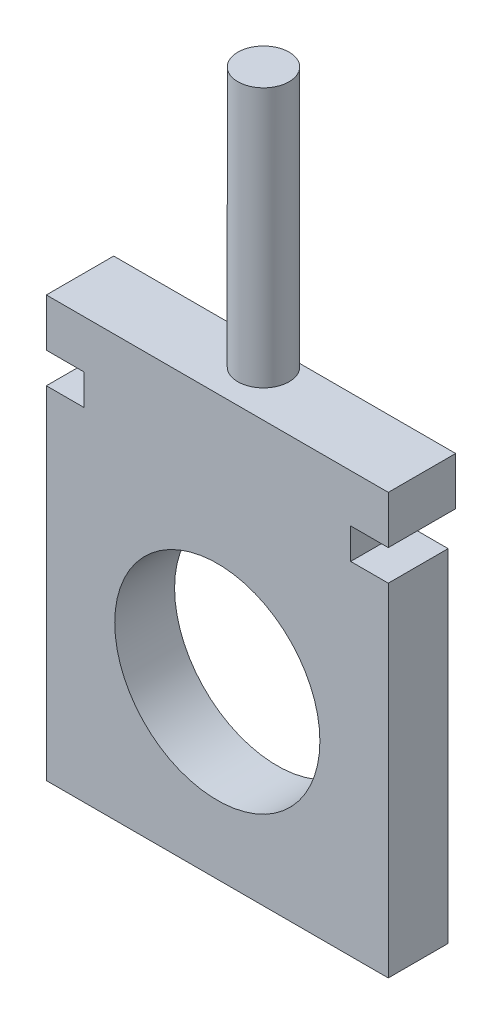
ISO-10303-21;
HEADER;
FILE_DESCRIPTION(('STEP AP214'),'2;1');
FILE_NAME('part.step','',(''),(''),'','','');
FILE_SCHEMA(('AUTOMOTIVE_DESIGN { 1 0 10303 214 1 1 1 1 }'));
ENDSEC;
DATA;
#1=APPLICATION_CONTEXT('core data for automotive mechanical design processes');
#2=APPLICATION_PROTOCOL_DEFINITION('international standard','automotive_design',2000,#1);
#3=PRODUCT_CONTEXT('',#1,'mechanical');
#4=PRODUCT('Part','Part','',(#3));
#5=PRODUCT_RELATED_PRODUCT_CATEGORY('part','',(#4));
#6=PRODUCT_DEFINITION_FORMATION('','',#4);
#7=PRODUCT_DEFINITION_CONTEXT('part definition',#1,'design');
#8=PRODUCT_DEFINITION('design','',#6,#7);
#9=PRODUCT_DEFINITION_SHAPE('','',#8);
#10=(LENGTH_UNIT() NAMED_UNIT(*) SI_UNIT(.MILLI.,.METRE.));
#11=(NAMED_UNIT(*) PLANE_ANGLE_UNIT() SI_UNIT($,.RADIAN.));
#12=(NAMED_UNIT(*) SI_UNIT($,.STERADIAN.) SOLID_ANGLE_UNIT());
#13=UNCERTAINTY_MEASURE_WITH_UNIT(LENGTH_MEASURE(1.E-05),#10,'distance_accuracy_value','');
#14=(GEOMETRIC_REPRESENTATION_CONTEXT(3) GLOBAL_UNCERTAINTY_ASSIGNED_CONTEXT((#13)) GLOBAL_UNIT_ASSIGNED_CONTEXT((#10,
#11,#12)) REPRESENTATION_CONTEXT('',''));
#15=CARTESIAN_POINT('',(0.,0.,0.));
#16=DIRECTION('',(0.,0.,1.));
#17=DIRECTION('',(1.,0.,0.));
#18=AXIS2_PLACEMENT_3D('',#15,#16,#17);
#19=CARTESIAN_POINT('',(-63.5,63.5,22.225));
#20=DIRECTION('',(0.,-1.,0.));
#21=DIRECTION('',(0.,0.,-1.));
#22=AXIS2_PLACEMENT_3D('',#19,#20,#21);
#23=PLANE('',#22);
#24=DIRECTION('',(0.,0.,-1.));
#25=VECTOR('',#24,1.);
#26=CARTESIAN_POINT('',(49.53,63.5,22.225));
#27=LINE('',#26,#25);
#28=CARTESIAN_POINT('',(49.53,63.5,22.225));
#29=VERTEX_POINT('',#28);
#30=CARTESIAN_POINT('',(49.53,63.5,9.525));
#31=VERTEX_POINT('',#30);
#32=EDGE_CURVE('E177',#29,#31,#27,.T.);
#33=ORIENTED_EDGE('',*,*,#32,.F.);
#34=DIRECTION('',(-1.,0.,0.));
#35=VECTOR('',#34,1.);
#36=CARTESIAN_POINT('',(-63.5,63.5,22.225));
#37=LINE('',#36,#35);
#38=CARTESIAN_POINT('',(63.5,63.5,22.225));
#39=VERTEX_POINT('',#38);
#40=EDGE_CURVE('E242',#39,#29,#37,.T.);
#41=ORIENTED_EDGE('',*,*,#40,.F.);
#42=DIRECTION('',(0.,0.,-1.));
#43=VECTOR('',#42,1.);
#44=CARTESIAN_POINT('',(63.5,63.5,22.225));
#45=LINE('',#44,#43);
#46=CARTESIAN_POINT('',(63.5,63.5,0.));
#47=VERTEX_POINT('',#46);
#48=EDGE_CURVE('E42',#39,#47,#45,.T.);
#49=ORIENTED_EDGE('',*,*,#48,.T.);
#50=DIRECTION('',(-1.,0.,0.));
#51=VECTOR('',#50,1.);
#52=CARTESIAN_POINT('',(-63.5,63.5,0.));
#53=LINE('',#52,#51);
#54=CARTESIAN_POINT('',(-63.5,63.5,0.));
#55=VERTEX_POINT('',#54);
#56=EDGE_CURVE('E258',#47,#55,#53,.T.);
#57=ORIENTED_EDGE('',*,*,#56,.T.);
#58=DIRECTION('',(0.,0.,-1.));
#59=VECTOR('',#58,1.);
#60=CARTESIAN_POINT('',(-63.5,63.5,22.225));
#61=LINE('',#60,#59);
#62=CARTESIAN_POINT('',(-63.5,63.5,22.225));
#63=VERTEX_POINT('',#62);
#64=EDGE_CURVE('E270',#63,#55,#61,.T.);
#65=ORIENTED_EDGE('',*,*,#64,.F.);
#66=CARTESIAN_POINT('',(-49.53,63.5,22.225));
#67=VERTEX_POINT('',#66);
#68=EDGE_CURVE('E239',#67,#63,#37,.T.);
#69=ORIENTED_EDGE('',*,*,#68,.F.);
#70=DIRECTION('',(0.,0.,1.));
#71=VECTOR('',#70,1.);
#72=CARTESIAN_POINT('',(-49.53,63.5,22.225));
#73=LINE('',#72,#71);
#74=CARTESIAN_POINT('',(-49.53,63.5,9.525));
#75=VERTEX_POINT('',#74);
#76=EDGE_CURVE('E211',#75,#67,#73,.T.);
#77=ORIENTED_EDGE('',*,*,#76,.F.);
#78=DIRECTION('',(-1.,0.,0.));
#79=VECTOR('',#78,1.);
#80=CARTESIAN_POINT('',(-49.53,63.5,9.525));
#81=LINE('',#80,#79);
#82=EDGE_CURVE('E57',#31,#75,#81,.T.);
#83=ORIENTED_EDGE('',*,*,#82,.F.);
#84=EDGE_LOOP('',(#33,#41,#49,#57,#65,#69,#77,#83));
#85=FACE_BOUND('',#84,.T.);
#86=ADVANCED_FACE('F33',(#85),#23,.F.);
#87=CARTESIAN_POINT('',(63.5,63.5,22.225));
#88=DIRECTION('',(-1.,0.,0.));
#89=DIRECTION('',(0.,-1.,0.));
#90=AXIS2_PLACEMENT_3D('',#87,#88,#89);
#91=PLANE('',#90);
#92=DIRECTION('',(0.,1.,0.));
#93=VECTOR('',#92,1.);
#94=CARTESIAN_POINT('',(63.5,63.5,0.));
#95=LINE('',#94,#93);
#96=CARTESIAN_POINT('',(63.5,-63.5,0.));
#97=VERTEX_POINT('',#96);
#98=EDGE_CURVE('E255',#97,#47,#95,.T.);
#99=ORIENTED_EDGE('',*,*,#98,.T.);
#100=ORIENTED_EDGE('',*,*,#48,.F.);
#101=DIRECTION('',(0.,1.,0.));
#102=VECTOR('',#101,1.);
#103=CARTESIAN_POINT('',(63.5,63.5,22.225));
#104=LINE('',#103,#102);
#105=CARTESIAN_POINT('',(63.5,-63.5,22.225));
#106=VERTEX_POINT('',#105);
#107=EDGE_CURVE('E243',#106,#39,#104,.T.);
#108=ORIENTED_EDGE('',*,*,#107,.F.);
#109=DIRECTION('',(0.,0.,-1.));
#110=VECTOR('',#109,1.);
#111=CARTESIAN_POINT('',(63.5,-63.5,22.225));
#112=LINE('',#111,#110);
#113=EDGE_CURVE('E254',#106,#97,#112,.T.);
#114=ORIENTED_EDGE('',*,*,#113,.T.);
#115=EDGE_LOOP('',(#99,#100,#108,#114));
#116=FACE_BOUND('',#115,.T.);
#117=ADVANCED_FACE('F35',(#116),#91,.F.);
#118=CARTESIAN_POINT('',(-63.5,63.5,22.225));
#119=DIRECTION('',(1.,0.,0.));
#120=DIRECTION('',(0.,0.,-1.));
#121=AXIS2_PLACEMENT_3D('',#118,#119,#120);
#122=PLANE('',#121);
#123=DIRECTION('',(0.,-1.,0.));
#124=VECTOR('',#123,1.);
#125=CARTESIAN_POINT('',(-63.5,63.5,0.));
#126=LINE('',#125,#124);
#127=CARTESIAN_POINT('',(-63.5,-63.5,0.));
#128=VERTEX_POINT('',#127);
#129=EDGE_CURVE('E261',#55,#128,#126,.T.);
#130=ORIENTED_EDGE('',*,*,#129,.T.);
#131=DIRECTION('',(0.,0.,-1.));
#132=VECTOR('',#131,1.);
#133=CARTESIAN_POINT('',(-63.5,-63.5,22.225));
#134=LINE('',#133,#132);
#135=CARTESIAN_POINT('',(-63.5,-63.5,22.225));
#136=VERTEX_POINT('',#135);
#137=EDGE_CURVE('E267',#136,#128,#134,.T.);
#138=ORIENTED_EDGE('',*,*,#137,.F.);
#139=DIRECTION('',(0.,-1.,0.));
#140=VECTOR('',#139,1.);
#141=CARTESIAN_POINT('',(-63.5,63.5,22.225));
#142=LINE('',#141,#140);
#143=EDGE_CURVE('E249',#63,#136,#142,.T.);
#144=ORIENTED_EDGE('',*,*,#143,.F.);
#145=ORIENTED_EDGE('',*,*,#64,.T.);
#146=EDGE_LOOP('',(#130,#138,#144,#145));
#147=FACE_BOUND('',#146,.T.);
#148=ADVANCED_FACE('F285',(#147),#122,.F.);
#149=CARTESIAN_POINT('',(-63.5,-63.5,22.225));
#150=DIRECTION('',(0.,1.,0.));
#151=DIRECTION('',(0.,0.,1.));
#152=AXIS2_PLACEMENT_3D('',#149,#150,#151);
#153=PLANE('',#152);
#154=DIRECTION('',(1.,0.,0.));
#155=VECTOR('',#154,1.);
#156=CARTESIAN_POINT('',(-63.5,-63.5,0.));
#157=LINE('',#156,#155);
#158=EDGE_CURVE('E263',#128,#97,#157,.T.);
#159=ORIENTED_EDGE('',*,*,#158,.T.);
#160=ORIENTED_EDGE('',*,*,#113,.F.);
#161=DIRECTION('',(1.,0.,0.));
#162=VECTOR('',#161,1.);
#163=CARTESIAN_POINT('',(-63.5,-63.5,22.225));
#164=LINE('',#163,#162);
#165=EDGE_CURVE('E252',#136,#106,#164,.T.);
#166=ORIENTED_EDGE('',*,*,#165,.F.);
#167=ORIENTED_EDGE('',*,*,#137,.T.);
#168=EDGE_LOOP('',(#159,#160,#166,#167));
#169=FACE_BOUND('',#168,.T.);
#170=ADVANCED_FACE('F289',(#169),#153,.F.);
#171=CARTESIAN_POINT('',(0.,0.,22.225));
#172=DIRECTION('',(0.,0.,1.));
#173=DIRECTION('',(1.,0.,0.));
#174=AXIS2_PLACEMENT_3D('',#171,#172,#173);
#175=PLANE('',#174);
#176=CARTESIAN_POINT('',(0.,0.,22.225));
#177=DIRECTION('',(0.,0.,1.));
#178=DIRECTION('',(1.,0.,0.));
#179=AXIS2_PLACEMENT_3D('',#176,#177,#178);
#180=CIRCLE('',#179,38.1);
#181=CARTESIAN_POINT('',(38.1,0.,22.225));
#182=VERTEX_POINT('',#181);
#183=EDGE_CURVE('E295',#182,#182,#180,.T.);
#184=ORIENTED_EDGE('',*,*,#183,.F.);
#185=EDGE_LOOP('',(#184));
#186=FACE_BOUND('',#185,.T.);
#187=ORIENTED_EDGE('',*,*,#107,.T.);
#188=ORIENTED_EDGE('',*,*,#40,.T.);
#189=DIRECTION('',(0.,-1.,0.));
#190=VECTOR('',#189,1.);
#191=CARTESIAN_POINT('',(49.53,74.93,22.225));
#192=LINE('',#191,#190);
#193=CARTESIAN_POINT('',(49.53,74.93,22.225));
#194=VERTEX_POINT('',#193);
#195=EDGE_CURVE('E203',#194,#29,#192,.T.);
#196=ORIENTED_EDGE('',*,*,#195,.F.);
#197=DIRECTION('',(1.,0.,0.));
#198=VECTOR('',#197,1.);
#199=CARTESIAN_POINT('',(-63.5,74.93,22.225));
#200=LINE('',#199,#198);
#201=CARTESIAN_POINT('',(63.5,74.93,22.225));
#202=VERTEX_POINT('',#201);
#203=EDGE_CURVE('E162',#194,#202,#200,.T.);
#204=ORIENTED_EDGE('',*,*,#203,.T.);
#205=DIRECTION('',(0.,-1.,0.));
#206=VECTOR('',#205,1.);
#207=CARTESIAN_POINT('',(63.5,92.71,22.225));
#208=LINE('',#207,#206);
#209=CARTESIAN_POINT('',(63.5,92.71,22.225));
#210=VERTEX_POINT('',#209);
#211=EDGE_CURVE('E178',#210,#202,#208,.T.);
#212=ORIENTED_EDGE('',*,*,#211,.F.);
#213=DIRECTION('',(1.,0.,0.));
#214=VECTOR('',#213,1.);
#215=CARTESIAN_POINT('',(-63.5,92.71,22.225));
#216=LINE('',#215,#214);
#217=CARTESIAN_POINT('',(-63.5,92.71,22.225));
#218=VERTEX_POINT('',#217);
#219=EDGE_CURVE('E156',#218,#210,#216,.T.);
#220=ORIENTED_EDGE('',*,*,#219,.F.);
#221=DIRECTION('',(0.,-1.,0.));
#222=VECTOR('',#221,1.);
#223=CARTESIAN_POINT('',(-63.5,92.71,22.225));
#224=LINE('',#223,#222);
#225=CARTESIAN_POINT('',(-63.5,74.93,22.225));
#226=VERTEX_POINT('',#225);
#227=EDGE_CURVE('E174',#218,#226,#224,.T.);
#228=ORIENTED_EDGE('',*,*,#227,.T.);
#229=CARTESIAN_POINT('',(-49.53,74.93,22.225));
#230=VERTEX_POINT('',#229);
#231=EDGE_CURVE('E171',#226,#230,#200,.T.);
#232=ORIENTED_EDGE('',*,*,#231,.T.);
#233=DIRECTION('',(0.,-1.,0.));
#234=VECTOR('',#233,1.);
#235=CARTESIAN_POINT('',(-49.53,74.93,22.225));
#236=LINE('',#235,#234);
#237=EDGE_CURVE('E230',#230,#67,#236,.T.);
#238=ORIENTED_EDGE('',*,*,#237,.T.);
#239=ORIENTED_EDGE('',*,*,#68,.T.);
#240=ORIENTED_EDGE('',*,*,#143,.T.);
#241=ORIENTED_EDGE('',*,*,#165,.T.);
#242=EDGE_LOOP('',(#187,#188,#196,#204,#212,#220,#228,#232,#238,#239,#240,#241));
#243=FACE_BOUND('',#242,.T.);
#244=ADVANCED_FACE('F200',(#186,#243),#175,.T.);
#245=CARTESIAN_POINT('',(0.,0.,0.));
#246=DIRECTION('',(0.,0.,1.));
#247=DIRECTION('',(1.,0.,0.));
#248=AXIS2_PLACEMENT_3D('',#245,#246,#247);
#249=PLANE('',#248);
#250=CARTESIAN_POINT('',(0.,0.,0.));
#251=DIRECTION('',(0.,0.,1.));
#252=DIRECTION('',(1.,0.,0.));
#253=AXIS2_PLACEMENT_3D('',#250,#251,#252);
#254=CIRCLE('',#253,38.1);
#255=CARTESIAN_POINT('',(38.1,0.,0.));
#256=VERTEX_POINT('',#255);
#257=EDGE_CURVE('E259',#256,#256,#254,.T.);
#258=ORIENTED_EDGE('',*,*,#257,.T.);
#259=EDGE_LOOP('',(#258));
#260=FACE_BOUND('',#259,.T.);
#261=ORIENTED_EDGE('',*,*,#98,.F.);
#262=ORIENTED_EDGE('',*,*,#158,.F.);
#263=ORIENTED_EDGE('',*,*,#129,.F.);
#264=ORIENTED_EDGE('',*,*,#56,.F.);
#265=EDGE_LOOP('',(#261,#262,#263,#264));
#266=FACE_BOUND('',#265,.T.);
#267=ADVANCED_FACE('F281',(#260,#266),#249,.F.);
#268=CARTESIAN_POINT('',(0.,0.,0.));
#269=DIRECTION('',(0.,0.,1.));
#270=DIRECTION('',(1.,0.,0.));
#271=AXIS2_PLACEMENT_3D('',#268,#269,#270);
#272=CYLINDRICAL_SURFACE('',#271,38.1);
#273=ORIENTED_EDGE('',*,*,#257,.F.);
#274=EDGE_LOOP('',(#273));
#275=FACE_BOUND('',#274,.T.);
#276=ORIENTED_EDGE('',*,*,#183,.T.);
#277=EDGE_LOOP('',(#276));
#278=FACE_BOUND('',#277,.T.);
#279=ADVANCED_FACE('F298',(#275,#278),#272,.F.);
#280=CARTESIAN_POINT('',(49.53,74.93,22.225));
#281=DIRECTION('',(-1.,0.,0.));
#282=DIRECTION('',(0.,0.,1.));
#283=AXIS2_PLACEMENT_3D('',#280,#281,#282);
#284=PLANE('',#283);
#285=ORIENTED_EDGE('',*,*,#32,.T.);
#286=DIRECTION('',(0.,-1.,0.));
#287=VECTOR('',#286,1.);
#288=CARTESIAN_POINT('',(49.53,74.93,9.525));
#289=LINE('',#288,#287);
#290=CARTESIAN_POINT('',(49.53,74.93,9.525));
#291=VERTEX_POINT('',#290);
#292=EDGE_CURVE('E233',#291,#31,#289,.T.);
#293=ORIENTED_EDGE('',*,*,#292,.F.);
#294=DIRECTION('',(0.,0.,-1.));
#295=VECTOR('',#294,1.);
#296=CARTESIAN_POINT('',(49.53,74.93,22.225));
#297=LINE('',#296,#295);
#298=EDGE_CURVE('E207',#194,#291,#297,.T.);
#299=ORIENTED_EDGE('',*,*,#298,.F.);
#300=ORIENTED_EDGE('',*,*,#195,.T.);
#301=EDGE_LOOP('',(#285,#293,#299,#300));
#302=FACE_BOUND('',#301,.T.);
#303=ADVANCED_FACE('F296',(#302),#284,.F.);
#304=CARTESIAN_POINT('',(-49.53,74.93,9.525));
#305=DIRECTION('',(0.,0.,1.));
#306=DIRECTION('',(1.,0.,0.));
#307=AXIS2_PLACEMENT_3D('',#304,#305,#306);
#308=PLANE('',#307);
#309=ORIENTED_EDGE('',*,*,#82,.T.);
#310=DIRECTION('',(0.,-1.,0.));
#311=VECTOR('',#310,1.);
#312=CARTESIAN_POINT('',(-49.53,74.93,9.525));
#313=LINE('',#312,#311);
#314=CARTESIAN_POINT('',(-49.53,74.93,9.525));
#315=VERTEX_POINT('',#314);
#316=EDGE_CURVE('E225',#315,#75,#313,.T.);
#317=ORIENTED_EDGE('',*,*,#316,.F.);
#318=DIRECTION('',(-1.,0.,0.));
#319=VECTOR('',#318,1.);
#320=CARTESIAN_POINT('',(-49.53,74.93,9.525));
#321=LINE('',#320,#319);
#322=EDGE_CURVE('E208',#291,#315,#321,.T.);
#323=ORIENTED_EDGE('',*,*,#322,.F.);
#324=ORIENTED_EDGE('',*,*,#292,.T.);
#325=EDGE_LOOP('',(#309,#317,#323,#324));
#326=FACE_BOUND('',#325,.T.);
#327=ADVANCED_FACE('F294',(#326),#308,.F.);
#328=CARTESIAN_POINT('',(-49.53,74.93,22.225));
#329=DIRECTION('',(1.,0.,0.));
#330=DIRECTION('',(0.,0.,-1.));
#331=AXIS2_PLACEMENT_3D('',#328,#329,#330);
#332=PLANE('',#331);
#333=ORIENTED_EDGE('',*,*,#76,.T.);
#334=ORIENTED_EDGE('',*,*,#237,.F.);
#335=DIRECTION('',(0.,0.,1.));
#336=VECTOR('',#335,1.);
#337=CARTESIAN_POINT('',(-49.53,74.93,22.225));
#338=LINE('',#337,#336);
#339=EDGE_CURVE('E212',#315,#230,#338,.T.);
#340=ORIENTED_EDGE('',*,*,#339,.F.);
#341=ORIENTED_EDGE('',*,*,#316,.T.);
#342=EDGE_LOOP('',(#333,#334,#340,#341));
#343=FACE_BOUND('',#342,.T.);
#344=ADVANCED_FACE('F291',(#343),#332,.F.);
#345=CARTESIAN_POINT('',(0.,74.93,0.));
#346=DIRECTION('',(0.,1.,0.));
#347=DIRECTION('',(0.,0.,1.));
#348=AXIS2_PLACEMENT_3D('',#345,#346,#347);
#349=PLANE('',#348);
#350=ORIENTED_EDGE('',*,*,#203,.F.);
#351=ORIENTED_EDGE('',*,*,#298,.T.);
#352=ORIENTED_EDGE('',*,*,#322,.T.);
#353=ORIENTED_EDGE('',*,*,#339,.T.);
#354=ORIENTED_EDGE('',*,*,#231,.F.);
#355=DIRECTION('',(0.,0.,1.));
#356=VECTOR('',#355,1.);
#357=CARTESIAN_POINT('',(-63.5,74.93,-2.794));
#358=LINE('',#357,#356);
#359=CARTESIAN_POINT('',(-63.5,74.93,-2.794));
#360=VERTEX_POINT('',#359);
#361=EDGE_CURVE('E150',#360,#226,#358,.T.);
#362=ORIENTED_EDGE('',*,*,#361,.F.);
#363=DIRECTION('',(-1.,0.,0.));
#364=VECTOR('',#363,1.);
#365=CARTESIAN_POINT('',(-63.5,74.93,-2.794));
#366=LINE('',#365,#364);
#367=CARTESIAN_POINT('',(63.5,74.93,-2.794));
#368=VERTEX_POINT('',#367);
#369=EDGE_CURVE('E157',#368,#360,#366,.T.);
#370=ORIENTED_EDGE('',*,*,#369,.F.);
#371=DIRECTION('',(0.,0.,-1.));
#372=VECTOR('',#371,1.);
#373=CARTESIAN_POINT('',(63.5,74.93,-2.794));
#374=LINE('',#373,#372);
#375=EDGE_CURVE('E165',#202,#368,#374,.T.);
#376=ORIENTED_EDGE('',*,*,#375,.F.);
#377=EDGE_LOOP('',(#350,#351,#352,#353,#354,#362,#370,#376));
#378=FACE_BOUND('',#377,.T.);
#379=ADVANCED_FACE('F192',(#378),#349,.F.);
#380=CARTESIAN_POINT('',(-63.5,92.71,-2.794));
#381=DIRECTION('',(1.,0.,0.));
#382=DIRECTION('',(0.,0.,-1.));
#383=AXIS2_PLACEMENT_3D('',#380,#381,#382);
#384=PLANE('',#383);
#385=ORIENTED_EDGE('',*,*,#361,.T.);
#386=ORIENTED_EDGE('',*,*,#227,.F.);
#387=DIRECTION('',(0.,0.,1.));
#388=VECTOR('',#387,1.);
#389=CARTESIAN_POINT('',(-63.5,92.71,-2.794));
#390=LINE('',#389,#388);
#391=CARTESIAN_POINT('',(-63.5,92.71,-2.794));
#392=VERTEX_POINT('',#391);
#393=EDGE_CURVE('E153',#392,#218,#390,.T.);
#394=ORIENTED_EDGE('',*,*,#393,.F.);
#395=DIRECTION('',(0.,-1.,0.));
#396=VECTOR('',#395,1.);
#397=CARTESIAN_POINT('',(-63.5,92.71,-2.794));
#398=LINE('',#397,#396);
#399=EDGE_CURVE('E135',#392,#360,#398,.T.);
#400=ORIENTED_EDGE('',*,*,#399,.T.);
#401=EDGE_LOOP('',(#385,#386,#394,#400));
#402=FACE_BOUND('',#401,.T.);
#403=ADVANCED_FACE('F196',(#402),#384,.F.);
#404=CARTESIAN_POINT('',(63.5,92.71,-2.794));
#405=DIRECTION('',(-1.,0.,0.));
#406=DIRECTION('',(0.,0.,1.));
#407=AXIS2_PLACEMENT_3D('',#404,#405,#406);
#408=PLANE('',#407);
#409=ORIENTED_EDGE('',*,*,#375,.T.);
#410=DIRECTION('',(0.,-1.,0.));
#411=VECTOR('',#410,1.);
#412=CARTESIAN_POINT('',(63.5,92.71,-2.794));
#413=LINE('',#412,#411);
#414=CARTESIAN_POINT('',(63.5,92.71,-2.794));
#415=VERTEX_POINT('',#414);
#416=EDGE_CURVE('E181',#415,#368,#413,.T.);
#417=ORIENTED_EDGE('',*,*,#416,.F.);
#418=DIRECTION('',(0.,0.,-1.));
#419=VECTOR('',#418,1.);
#420=CARTESIAN_POINT('',(63.5,92.71,-2.794));
#421=LINE('',#420,#419);
#422=EDGE_CURVE('E131',#210,#415,#421,.T.);
#423=ORIENTED_EDGE('',*,*,#422,.F.);
#424=ORIENTED_EDGE('',*,*,#211,.T.);
#425=EDGE_LOOP('',(#409,#417,#423,#424));
#426=FACE_BOUND('',#425,.T.);
#427=ADVANCED_FACE('F187',(#426),#408,.F.);
#428=CARTESIAN_POINT('',(-63.5,92.71,-2.794));
#429=DIRECTION('',(0.,0.,1.));
#430=DIRECTION('',(1.,0.,0.));
#431=AXIS2_PLACEMENT_3D('',#428,#429,#430);
#432=PLANE('',#431);
#433=ORIENTED_EDGE('',*,*,#369,.T.);
#434=ORIENTED_EDGE('',*,*,#399,.F.);
#435=DIRECTION('',(-1.,0.,0.));
#436=VECTOR('',#435,1.);
#437=CARTESIAN_POINT('',(-63.5,92.71,-2.794));
#438=LINE('',#437,#436);
#439=CARTESIAN_POINT('',(-5.35964075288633,92.71,-2.794));
#440=VERTEX_POINT('',#439);
#441=EDGE_CURVE('E138',#440,#392,#438,.T.);
#442=ORIENTED_EDGE('',*,*,#441,.F.);
#443=CARTESIAN_POINT('',(5.35964075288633,92.71,-2.794));
#444=VERTEX_POINT('',#443);
#445=EDGE_CURVE('E136',#444,#440,#438,.T.);
#446=ORIENTED_EDGE('',*,*,#445,.F.);
#447=EDGE_CURVE('E127',#415,#444,#438,.T.);
#448=ORIENTED_EDGE('',*,*,#447,.F.);
#449=ORIENTED_EDGE('',*,*,#416,.T.);
#450=EDGE_LOOP('',(#433,#434,#442,#446,#448,#449));
#451=FACE_BOUND('',#450,.T.);
#452=ADVANCED_FACE('F140',(#451),#432,.F.);
#453=CARTESIAN_POINT('',(0.,92.71,0.));
#454=DIRECTION('',(0.,1.,0.));
#455=DIRECTION('',(0.,0.,1.));
#456=AXIS2_PLACEMENT_3D('',#453,#454,#455);
#457=PLANE('',#456);
#458=CARTESIAN_POINT('',(0.,92.71,5.08));
#459=DIRECTION('',(0.,1.,0.));
#460=DIRECTION('',(0.,0.,1.));
#461=AXIS2_PLACEMENT_3D('',#458,#459,#460);
#462=CIRCLE('',#461,9.525);
#463=EDGE_CURVE('E11',#440,#444,#462,.T.);
#464=ORIENTED_EDGE('',*,*,#463,.F.);
#465=ORIENTED_EDGE('',*,*,#441,.T.);
#466=ORIENTED_EDGE('',*,*,#393,.T.);
#467=ORIENTED_EDGE('',*,*,#219,.T.);
#468=ORIENTED_EDGE('',*,*,#422,.T.);
#469=ORIENTED_EDGE('',*,*,#447,.T.);
#470=EDGE_LOOP('',(#464,#465,#466,#467,#468,#469));
#471=FACE_BOUND('',#470,.T.);
#472=ADVANCED_FACE('F129',(#471),#457,.T.);
#473=CARTESIAN_POINT('',(0.,92.71,5.08));
#474=DIRECTION('',(0.,1.,0.));
#475=DIRECTION('',(0.,0.,1.));
#476=AXIS2_PLACEMENT_3D('',#473,#474,#475);
#477=PLANE('',#476);
#478=EDGE_CURVE('E44',#444,#440,#462,.T.);
#479=ORIENTED_EDGE('',*,*,#478,.F.);
#480=ORIENTED_EDGE('',*,*,#445,.T.);
#481=EDGE_LOOP('',(#479,#480));
#482=FACE_BOUND('',#481,.T.);
#483=ADVANCED_FACE('F147',(#482),#477,.F.);
#484=CARTESIAN_POINT('',(0.,189.23,5.08));
#485=DIRECTION('',(0.,-1.,0.));
#486=DIRECTION('',(0.,0.,-1.));
#487=AXIS2_PLACEMENT_3D('',#484,#485,#486);
#488=CYLINDRICAL_SURFACE('',#487,9.525);
#489=CARTESIAN_POINT('',(0.,189.23,5.08));
#490=DIRECTION('',(0.,1.,0.));
#491=DIRECTION('',(0.,0.,1.));
#492=AXIS2_PLACEMENT_3D('',#489,#490,#491);
#493=CIRCLE('',#492,9.525);
#494=CARTESIAN_POINT('',(0.,189.23,14.605));
#495=VERTEX_POINT('',#494);
#496=EDGE_CURVE('E148',#495,#495,#493,.T.);
#497=ORIENTED_EDGE('',*,*,#496,.F.);
#498=EDGE_LOOP('',(#497));
#499=FACE_BOUND('',#498,.T.);
#500=ORIENTED_EDGE('',*,*,#478,.T.);
#501=ORIENTED_EDGE('',*,*,#463,.T.);
#502=EDGE_LOOP('',(#500,#501));
#503=FACE_BOUND('',#502,.T.);
#504=ADVANCED_FACE('F146',(#499,#503),#488,.T.);
#505=CARTESIAN_POINT('',(0.,189.23,5.08));
#506=DIRECTION('',(0.,1.,0.));
#507=DIRECTION('',(0.,0.,1.));
#508=AXIS2_PLACEMENT_3D('',#505,#506,#507);
#509=PLANE('',#508);
#510=ORIENTED_EDGE('',*,*,#496,.T.);
#511=EDGE_LOOP('',(#510));
#512=FACE_BOUND('',#511,.T.);
#513=ADVANCED_FACE('F426',(#512),#509,.T.);
#514=CLOSED_SHELL('',(#86,#117,#148,#170,#244,#267,#279,#303,#327,#344,#379,#403,#427,#452,#472,
#483,#504,#513));
#515=MANIFOLD_SOLID_BREP('B2',#514);
#516=ADVANCED_BREP_SHAPE_REPRESENTATION('',(#18,#515),#14);
#517=SHAPE_DEFINITION_REPRESENTATION(#9,#516);
ENDSEC;
END-ISO-10303-21;
